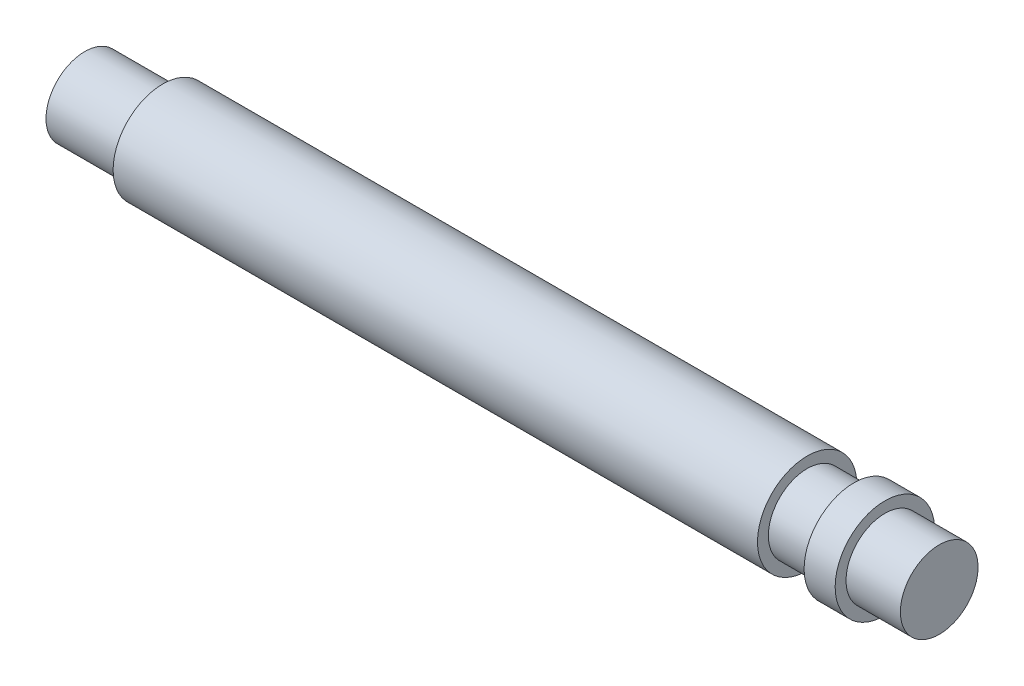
from build123d import *


with BuildPart() as part:
    # Sketch1 → Revolve1 (revolve)
    with BuildSketch(Plane.XY, mode=Mode.PRIVATE) as revolve1_sk:
        Polygon((0, 0), (0, 6.35), (-8.89, 6.35), (-8.89, 8.128), (-13.97, 8.128), (-13.97, 6.35), (-21.59, 6.35), (-21.59, 8.128), (-126.950325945, 8.128), (-126.950325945, 6.35), (-139.7, 6.35), (-139.7, 0), align=None)
    revolve(revolve1_sk.sketch.rotate(Axis((-139.7, 0, 0), (1, 0, 0)), 90), axis=Axis((-139.7, 0, 0), (1, 0, 0)))


solid = part.part
